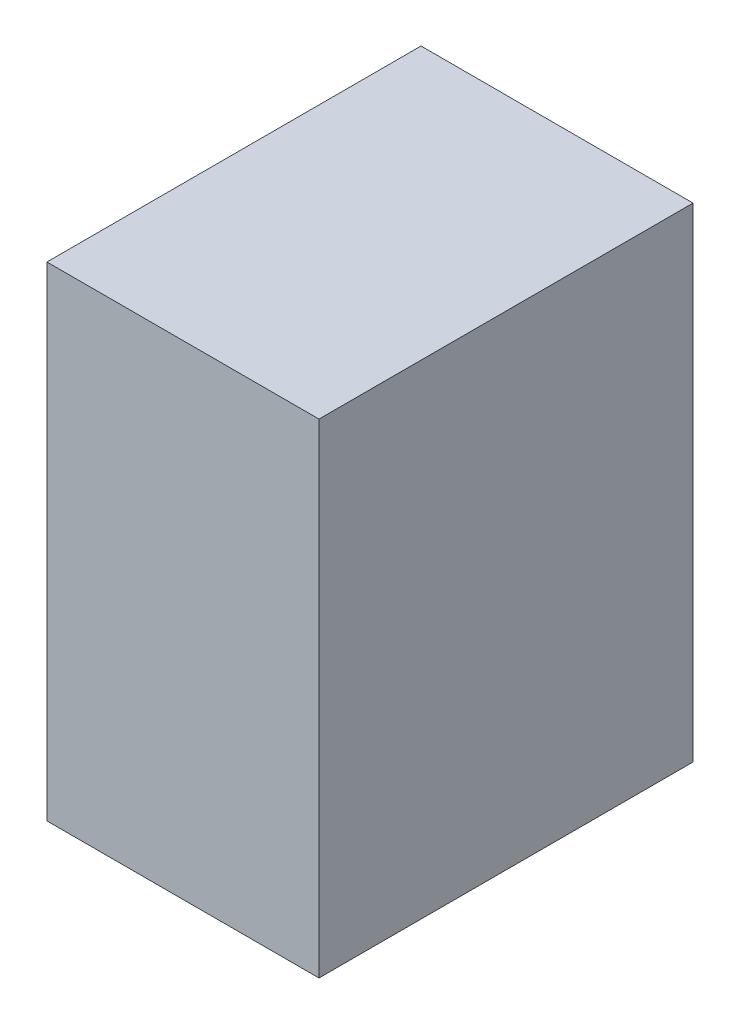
from build123d import *

# Parameters (mm, degrees)
SKETCH_1_W      = 240
SKETCH_1_H      = 427
EXTRUDE_1_DEPTH = 330


with BuildPart() as part:
    # Sketch 1 → Extrude 1 (new body)
    with BuildSketch(Plane.XY):
        Rectangle(SKETCH_1_W, SKETCH_1_H)
    extrude(amount=EXTRUDE_1_DEPTH)


solid = part.part
